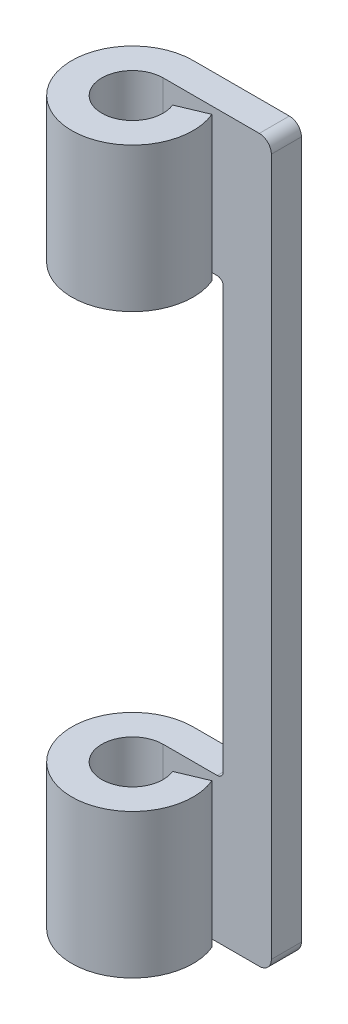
ISO-10303-21;
HEADER;
FILE_DESCRIPTION(('STEP AP214'),'2;1');
FILE_NAME('part.step','',(''),(''),'','','');
FILE_SCHEMA(('AUTOMOTIVE_DESIGN { 1 0 10303 214 1 1 1 1 }'));
ENDSEC;
DATA;
#1=APPLICATION_CONTEXT('core data for automotive mechanical design processes');
#2=APPLICATION_PROTOCOL_DEFINITION('international standard','automotive_design',2000,#1);
#3=PRODUCT_CONTEXT('',#1,'mechanical');
#4=PRODUCT('Part','Part','',(#3));
#5=PRODUCT_RELATED_PRODUCT_CATEGORY('part','',(#4));
#6=PRODUCT_DEFINITION_FORMATION('','',#4);
#7=PRODUCT_DEFINITION_CONTEXT('part definition',#1,'design');
#8=PRODUCT_DEFINITION('design','',#6,#7);
#9=PRODUCT_DEFINITION_SHAPE('','',#8);
#10=(LENGTH_UNIT() NAMED_UNIT(*) SI_UNIT(.MILLI.,.METRE.));
#11=(NAMED_UNIT(*) PLANE_ANGLE_UNIT() SI_UNIT($,.RADIAN.));
#12=(NAMED_UNIT(*) SI_UNIT($,.STERADIAN.) SOLID_ANGLE_UNIT());
#13=UNCERTAINTY_MEASURE_WITH_UNIT(LENGTH_MEASURE(1.E-05),#10,'distance_accuracy_value','');
#14=(GEOMETRIC_REPRESENTATION_CONTEXT(3) GLOBAL_UNCERTAINTY_ASSIGNED_CONTEXT((#13)) GLOBAL_UNIT_ASSIGNED_CONTEXT((#10,
#11,#12)) REPRESENTATION_CONTEXT('',''));
#15=CARTESIAN_POINT('',(0.,0.,0.));
#16=DIRECTION('',(0.,0.,1.));
#17=DIRECTION('',(1.,0.,0.));
#18=AXIS2_PLACEMENT_3D('',#15,#16,#17);
#19=CARTESIAN_POINT('',(4.658325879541,-30.,3.1));
#20=DIRECTION('',(-0.386138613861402,0.,-0.922440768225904));
#21=DIRECTION('',(-0.922440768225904,0.,0.386138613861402));
#22=AXIS2_PLACEMENT_3D('',#19,#20,#21);
#23=PLANE('',#22);
#24=DIRECTION('',(0.,1.,0.));
#25=VECTOR('',#24,1.);
#26=CARTESIAN_POINT('',(4.65832587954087,-30.,3.10000000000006));
#27=LINE('',#26,#25);
#28=CARTESIAN_POINT('',(4.65832587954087,18.,3.10000000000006));
#29=VERTEX_POINT('',#28);
#30=CARTESIAN_POINT('',(4.65832587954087,30.,3.10000000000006));
#31=VERTEX_POINT('',#30);
#32=EDGE_CURVE('E182',#29,#31,#27,.T.);
#33=ORIENTED_EDGE('',*,*,#32,.F.);
#34=DIRECTION('',(-0.92244076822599,0.,0.386138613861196));
#35=VECTOR('',#34,1.);
#36=CARTESIAN_POINT('',(4.658325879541,18.,3.1));
#37=LINE('',#36,#35);
#38=CARTESIAN_POINT('',(2.35222395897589,18.,4.06534653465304));
#39=VERTEX_POINT('',#38);
#40=EDGE_CURVE('E185',#29,#39,#37,.T.);
#41=ORIENTED_EDGE('',*,*,#40,.T.);
#42=DIRECTION('',(0.,1.,0.));
#43=VECTOR('',#42,1.);
#44=CARTESIAN_POINT('',(2.35222395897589,-30.,4.06534653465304));
#45=LINE('',#44,#43);
#46=CARTESIAN_POINT('',(2.35222395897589,30.,4.06534653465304));
#47=VERTEX_POINT('',#46);
#48=EDGE_CURVE('E145',#39,#47,#45,.T.);
#49=ORIENTED_EDGE('',*,*,#48,.T.);
#50=DIRECTION('',(-0.92244076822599,0.,0.386138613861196));
#51=VECTOR('',#50,1.);
#52=CARTESIAN_POINT('',(4.658325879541,30.,3.1));
#53=LINE('',#52,#51);
#54=EDGE_CURVE('E171',#31,#47,#53,.T.);
#55=ORIENTED_EDGE('',*,*,#54,.F.);
#56=EDGE_LOOP('',(#33,#41,#49,#55));
#57=FACE_BOUND('',#56,.T.);
#58=ADVANCED_FACE('F16',(#57),#23,.T.);
#59=CARTESIAN_POINT('',(0.,-30.,5.05));
#60=DIRECTION('',(0.,1.,0.));
#61=DIRECTION('',(0.,0.,1.));
#62=AXIS2_PLACEMENT_3D('',#59,#60,#61);
#63=CYLINDRICAL_SURFACE('',#62,2.55);
#64=CARTESIAN_POINT('',(0.,30.,5.05));
#65=DIRECTION('',(0.,1.,0.));
#66=DIRECTION('',(0.,0.,1.));
#67=AXIS2_PLACEMENT_3D('',#64,#65,#66);
#68=CIRCLE('',#67,2.55);
#69=CARTESIAN_POINT('',(0.,30.,2.5));
#70=VERTEX_POINT('',#69);
#71=EDGE_CURVE('E154',#47,#70,#68,.F.);
#72=ORIENTED_EDGE('',*,*,#71,.F.);
#73=ORIENTED_EDGE('',*,*,#48,.F.);
#74=CARTESIAN_POINT('',(0.,18.,5.05));
#75=DIRECTION('',(0.,1.,0.));
#76=DIRECTION('',(0.,0.,1.));
#77=AXIS2_PLACEMENT_3D('',#74,#75,#76);
#78=CIRCLE('',#77,2.55);
#79=CARTESIAN_POINT('',(0.,18.,2.5));
#80=VERTEX_POINT('',#79);
#81=EDGE_CURVE('E157',#39,#80,#78,.F.);
#82=ORIENTED_EDGE('',*,*,#81,.T.);
#83=DIRECTION('',(0.,1.,0.));
#84=VECTOR('',#83,1.);
#85=CARTESIAN_POINT('',(0.,-30.,2.5));
#86=LINE('',#85,#84);
#87=EDGE_CURVE('E150',#70,#80,#86,.F.);
#88=ORIENTED_EDGE('',*,*,#87,.F.);
#89=EDGE_LOOP('',(#72,#73,#82,#88));
#90=FACE_BOUND('',#89,.T.);
#91=ADVANCED_FACE('F152',(#90),#63,.F.);
#92=CARTESIAN_POINT('',(8.,29.,2.596018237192));
#93=DIRECTION('',(0.,0.,-1.));
#94=DIRECTION('',(-1.,0.,0.));
#95=AXIS2_PLACEMENT_3D('',#92,#93,#94);
#96=CYLINDRICAL_SURFACE('',#95,1.);
#97=CARTESIAN_POINT('',(8.,29.,2.5));
#98=DIRECTION('',(0.,0.,-1.));
#99=DIRECTION('',(-1.,0.,0.));
#100=AXIS2_PLACEMENT_3D('',#97,#98,#99);
#101=CIRCLE('',#100,1.);
#102=CARTESIAN_POINT('',(9.,29.,2.5));
#103=VERTEX_POINT('',#102);
#104=CARTESIAN_POINT('',(8.,30.,2.5));
#105=VERTEX_POINT('',#104);
#106=EDGE_CURVE('E161',#103,#105,#101,.F.);
#107=ORIENTED_EDGE('',*,*,#106,.F.);
#108=DIRECTION('',(0.,0.,-1.));
#109=VECTOR('',#108,1.);
#110=CARTESIAN_POINT('',(9.,29.,2.5));
#111=LINE('',#110,#109);
#112=CARTESIAN_POINT('',(9.,29.,0.));
#113=VERTEX_POINT('',#112);
#114=EDGE_CURVE('E232',#113,#103,#111,.F.);
#115=ORIENTED_EDGE('',*,*,#114,.F.);
#116=CARTESIAN_POINT('',(8.,29.,0.));
#117=DIRECTION('',(0.,0.,-1.));
#118=DIRECTION('',(-1.,0.,0.));
#119=AXIS2_PLACEMENT_3D('',#116,#117,#118);
#120=CIRCLE('',#119,1.);
#121=CARTESIAN_POINT('',(8.,30.,0.));
#122=VERTEX_POINT('',#121);
#123=EDGE_CURVE('E19',#113,#122,#120,.F.);
#124=ORIENTED_EDGE('',*,*,#123,.T.);
#125=DIRECTION('',(0.,0.,1.));
#126=VECTOR('',#125,1.);
#127=CARTESIAN_POINT('',(8.,30.,0.));
#128=LINE('',#127,#126);
#129=EDGE_CURVE('E168',#105,#122,#128,.F.);
#130=ORIENTED_EDGE('',*,*,#129,.F.);
#131=EDGE_LOOP('',(#107,#115,#124,#130));
#132=FACE_BOUND('',#131,.T.);
#133=ADVANCED_FACE('F259',(#132),#96,.T.);
#134=CARTESIAN_POINT('',(8.,-29.,-0.09771170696));
#135=DIRECTION('',(0.,0.,1.));
#136=DIRECTION('',(1.,0.,0.));
#137=AXIS2_PLACEMENT_3D('',#134,#135,#136);
#138=CYLINDRICAL_SURFACE('',#137,1.);
#139=CARTESIAN_POINT('',(8.,-29.,0.));
#140=DIRECTION('',(0.,0.,1.));
#141=DIRECTION('',(1.,0.,0.));
#142=AXIS2_PLACEMENT_3D('',#139,#140,#141);
#143=CIRCLE('',#142,1.);
#144=CARTESIAN_POINT('',(8.,-30.,0.));
#145=VERTEX_POINT('',#144);
#146=CARTESIAN_POINT('',(9.,-29.,0.));
#147=VERTEX_POINT('',#146);
#148=EDGE_CURVE('E196',#145,#147,#143,.T.);
#149=ORIENTED_EDGE('',*,*,#148,.T.);
#150=DIRECTION('',(0.,0.,-1.));
#151=VECTOR('',#150,1.);
#152=CARTESIAN_POINT('',(9.,-29.,2.5));
#153=LINE('',#152,#151);
#154=CARTESIAN_POINT('',(9.,-29.,2.5));
#155=VERTEX_POINT('',#154);
#156=EDGE_CURVE('E235',#155,#147,#153,.T.);
#157=ORIENTED_EDGE('',*,*,#156,.F.);
#158=CARTESIAN_POINT('',(8.,-29.,2.5));
#159=DIRECTION('',(0.,0.,1.));
#160=DIRECTION('',(1.,0.,0.));
#161=AXIS2_PLACEMENT_3D('',#158,#159,#160);
#162=CIRCLE('',#161,1.);
#163=CARTESIAN_POINT('',(8.,-30.,2.5));
#164=VERTEX_POINT('',#163);
#165=EDGE_CURVE('E192',#164,#155,#162,.T.);
#166=ORIENTED_EDGE('',*,*,#165,.F.);
#167=DIRECTION('',(0.,0.,1.));
#168=VECTOR('',#167,1.);
#169=CARTESIAN_POINT('',(8.,-30.,0.));
#170=LINE('',#169,#168);
#171=EDGE_CURVE('E230',#164,#145,#170,.F.);
#172=ORIENTED_EDGE('',*,*,#171,.T.);
#173=EDGE_LOOP('',(#149,#157,#166,#172));
#174=FACE_BOUND('',#173,.T.);
#175=ADVANCED_FACE('F256',(#174),#138,.T.);
#176=CARTESIAN_POINT('',(4.658325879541,-30.,3.1));
#177=DIRECTION('',(-0.386138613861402,0.,-0.922440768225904));
#178=DIRECTION('',(-0.922440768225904,0.,0.386138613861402));
#179=AXIS2_PLACEMENT_3D('',#176,#177,#178);
#180=PLANE('',#179);
#181=DIRECTION('',(0.,1.,0.));
#182=VECTOR('',#181,1.);
#183=CARTESIAN_POINT('',(2.35222395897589,-30.,4.06534653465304));
#184=LINE('',#183,#182);
#185=CARTESIAN_POINT('',(2.35222395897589,-30.,4.06534653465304));
#186=VERTEX_POINT('',#185);
#187=CARTESIAN_POINT('',(2.35222395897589,-18.,4.06534653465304));
#188=VERTEX_POINT('',#187);
#189=EDGE_CURVE('E195',#186,#188,#184,.T.);
#190=ORIENTED_EDGE('',*,*,#189,.T.);
#191=DIRECTION('',(-0.92244076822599,0.,0.386138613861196));
#192=VECTOR('',#191,1.);
#193=CARTESIAN_POINT('',(4.658325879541,-18.,3.1));
#194=LINE('',#193,#192);
#195=CARTESIAN_POINT('',(4.65832587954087,-18.,3.10000000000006));
#196=VERTEX_POINT('',#195);
#197=EDGE_CURVE('E210',#196,#188,#194,.T.);
#198=ORIENTED_EDGE('',*,*,#197,.F.);
#199=DIRECTION('',(0.,1.,0.));
#200=VECTOR('',#199,1.);
#201=CARTESIAN_POINT('',(4.65832587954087,-30.,3.10000000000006));
#202=LINE('',#201,#200);
#203=CARTESIAN_POINT('',(4.65832587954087,-30.,3.10000000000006));
#204=VERTEX_POINT('',#203);
#205=EDGE_CURVE('E213',#204,#196,#202,.T.);
#206=ORIENTED_EDGE('',*,*,#205,.F.);
#207=DIRECTION('',(-0.92244076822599,0.,0.386138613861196));
#208=VECTOR('',#207,1.);
#209=CARTESIAN_POINT('',(4.658325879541,-30.,3.1));
#210=LINE('',#209,#208);
#211=EDGE_CURVE('E224',#204,#186,#210,.T.);
#212=ORIENTED_EDGE('',*,*,#211,.T.);
#213=EDGE_LOOP('',(#190,#198,#206,#212));
#214=FACE_BOUND('',#213,.T.);
#215=ADVANCED_FACE('F258',(#214),#180,.T.);
#216=CARTESIAN_POINT('',(0.,-30.,5.05));
#217=DIRECTION('',(0.,1.,0.));
#218=DIRECTION('',(0.,0.,1.));
#219=AXIS2_PLACEMENT_3D('',#216,#217,#218);
#220=CYLINDRICAL_SURFACE('',#219,2.55);
#221=CARTESIAN_POINT('',(0.,-30.,5.05));
#222=DIRECTION('',(0.,1.,0.));
#223=DIRECTION('',(0.,0.,1.));
#224=AXIS2_PLACEMENT_3D('',#221,#222,#223);
#225=CIRCLE('',#224,2.55);
#226=CARTESIAN_POINT('',(0.,-30.,2.5));
#227=VERTEX_POINT('',#226);
#228=EDGE_CURVE('E176',#186,#227,#225,.F.);
#229=ORIENTED_EDGE('',*,*,#228,.T.);
#230=DIRECTION('',(0.,1.,0.));
#231=VECTOR('',#230,1.);
#232=CARTESIAN_POINT('',(0.,-30.,2.5));
#233=LINE('',#232,#231);
#234=CARTESIAN_POINT('',(0.,-18.,2.5));
#235=VERTEX_POINT('',#234);
#236=EDGE_CURVE('E124',#235,#227,#233,.F.);
#237=ORIENTED_EDGE('',*,*,#236,.F.);
#238=CARTESIAN_POINT('',(0.,-18.,5.05));
#239=DIRECTION('',(0.,1.,0.));
#240=DIRECTION('',(0.,0.,1.));
#241=AXIS2_PLACEMENT_3D('',#238,#239,#240);
#242=CIRCLE('',#241,2.55);
#243=EDGE_CURVE('E206',#188,#235,#242,.F.);
#244=ORIENTED_EDGE('',*,*,#243,.F.);
#245=ORIENTED_EDGE('',*,*,#189,.F.);
#246=EDGE_LOOP('',(#229,#237,#244,#245));
#247=FACE_BOUND('',#246,.T.);
#248=ADVANCED_FACE('F266',(#247),#220,.F.);
#249=CARTESIAN_POINT('',(4.5,17.5,2.596018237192));
#250=DIRECTION('',(0.,0.,-1.));
#251=DIRECTION('',(-1.,0.,0.));
#252=AXIS2_PLACEMENT_3D('',#249,#250,#251);
#253=CYLINDRICAL_SURFACE('',#252,0.5);
#254=DIRECTION('',(0.,0.,-1.));
#255=VECTOR('',#254,1.);
#256=CARTESIAN_POINT('',(5.,17.5,2.5));
#257=LINE('',#256,#255);
#258=CARTESIAN_POINT('',(5.,17.5,0.));
#259=VERTEX_POINT('',#258);
#260=CARTESIAN_POINT('',(5.,17.5,2.5));
#261=VERTEX_POINT('',#260);
#262=EDGE_CURVE('E251',#259,#261,#257,.F.);
#263=ORIENTED_EDGE('',*,*,#262,.T.);
#264=CARTESIAN_POINT('',(4.5,17.5,2.5));
#265=DIRECTION('',(0.,0.,-1.));
#266=DIRECTION('',(-1.,0.,0.));
#267=AXIS2_PLACEMENT_3D('',#264,#265,#266);
#268=CIRCLE('',#267,0.5);
#269=CARTESIAN_POINT('',(4.5,18.,2.5));
#270=VERTEX_POINT('',#269);
#271=EDGE_CURVE('E160',#270,#261,#268,.T.);
#272=ORIENTED_EDGE('',*,*,#271,.F.);
#273=DIRECTION('',(0.,0.,1.));
#274=VECTOR('',#273,1.);
#275=CARTESIAN_POINT('',(4.5,18.,0.));
#276=LINE('',#275,#274);
#277=CARTESIAN_POINT('',(4.5,18.,0.));
#278=VERTEX_POINT('',#277);
#279=EDGE_CURVE('E187',#270,#278,#276,.F.);
#280=ORIENTED_EDGE('',*,*,#279,.T.);
#281=CARTESIAN_POINT('',(4.5,17.5,0.));
#282=DIRECTION('',(0.,0.,-1.));
#283=DIRECTION('',(-1.,0.,0.));
#284=AXIS2_PLACEMENT_3D('',#281,#282,#283);
#285=CIRCLE('',#284,0.5);
#286=EDGE_CURVE('E194',#259,#278,#285,.F.);
#287=ORIENTED_EDGE('',*,*,#286,.F.);
#288=EDGE_LOOP('',(#263,#272,#280,#287));
#289=FACE_BOUND('',#288,.T.);
#290=ADVANCED_FACE('F308',(#289),#253,.F.);
#291=CARTESIAN_POINT('',(0.,-30.,2.5));
#292=DIRECTION('',(0.,0.,1.));
#293=DIRECTION('',(1.,0.,0.));
#294=AXIS2_PLACEMENT_3D('',#291,#292,#293);
#295=PLANE('',#294);
#296=CARTESIAN_POINT('',(4.5,-17.5,2.5));
#297=DIRECTION('',(0.,0.,1.));
#298=DIRECTION('',(1.,0.,0.));
#299=AXIS2_PLACEMENT_3D('',#296,#297,#298);
#300=CIRCLE('',#299,0.5);
#301=CARTESIAN_POINT('',(5.,-17.5,2.5));
#302=VERTEX_POINT('',#301);
#303=CARTESIAN_POINT('',(4.5,-18.,2.5));
#304=VERTEX_POINT('',#303);
#305=EDGE_CURVE('E115',#302,#304,#300,.F.);
#306=ORIENTED_EDGE('',*,*,#305,.T.);
#307=DIRECTION('',(1.,0.,0.));
#308=VECTOR('',#307,1.);
#309=CARTESIAN_POINT('',(0.,-18.,2.5));
#310=LINE('',#309,#308);
#311=EDGE_CURVE('E209',#235,#304,#310,.T.);
#312=ORIENTED_EDGE('',*,*,#311,.F.);
#313=ORIENTED_EDGE('',*,*,#236,.T.);
#314=DIRECTION('',(1.,0.,0.));
#315=VECTOR('',#314,1.);
#316=CARTESIAN_POINT('',(0.,-30.,2.5));
#317=LINE('',#316,#315);
#318=EDGE_CURVE('E216',#227,#164,#317,.T.);
#319=ORIENTED_EDGE('',*,*,#318,.T.);
#320=ORIENTED_EDGE('',*,*,#165,.T.);
#321=DIRECTION('',(0.,1.,0.));
#322=VECTOR('',#321,1.);
#323=CARTESIAN_POINT('',(9.,-30.,2.5));
#324=LINE('',#323,#322);
#325=EDGE_CURVE('E236',#103,#155,#324,.F.);
#326=ORIENTED_EDGE('',*,*,#325,.F.);
#327=ORIENTED_EDGE('',*,*,#106,.T.);
#328=DIRECTION('',(1.,0.,0.));
#329=VECTOR('',#328,1.);
#330=CARTESIAN_POINT('',(0.,30.,2.5));
#331=LINE('',#330,#329);
#332=EDGE_CURVE('E164',#70,#105,#331,.T.);
#333=ORIENTED_EDGE('',*,*,#332,.F.);
#334=ORIENTED_EDGE('',*,*,#87,.T.);
#335=DIRECTION('',(1.,0.,0.));
#336=VECTOR('',#335,1.);
#337=CARTESIAN_POINT('',(0.,18.,2.5));
#338=LINE('',#337,#336);
#339=EDGE_CURVE('E184',#80,#270,#338,.T.);
#340=ORIENTED_EDGE('',*,*,#339,.T.);
#341=ORIENTED_EDGE('',*,*,#271,.T.);
#342=DIRECTION('',(0.,1.,0.));
#343=VECTOR('',#342,1.);
#344=CARTESIAN_POINT('',(5.,18.,2.5));
#345=LINE('',#344,#343);
#346=EDGE_CURVE('E248',#261,#302,#345,.F.);
#347=ORIENTED_EDGE('',*,*,#346,.T.);
#348=EDGE_LOOP('',(#306,#312,#313,#319,#320,#326,#327,#333,#334,#340,#341,#347));
#349=FACE_BOUND('',#348,.T.);
#350=ADVANCED_FACE('F165',(#349),#295,.T.);
#351=CARTESIAN_POINT('',(4.5,-17.5,-0.09232407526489));
#352=DIRECTION('',(0.,0.,1.));
#353=DIRECTION('',(1.,0.,0.));
#354=AXIS2_PLACEMENT_3D('',#351,#352,#353);
#355=CYLINDRICAL_SURFACE('',#354,0.5);
#356=DIRECTION('',(0.,0.,-1.));
#357=VECTOR('',#356,1.);
#358=CARTESIAN_POINT('',(5.,-17.5,2.5));
#359=LINE('',#358,#357);
#360=CARTESIAN_POINT('',(5.,-17.5,0.));
#361=VERTEX_POINT('',#360);
#362=EDGE_CURVE('E250',#302,#361,#359,.T.);
#363=ORIENTED_EDGE('',*,*,#362,.T.);
#364=CARTESIAN_POINT('',(4.5,-17.5,0.));
#365=DIRECTION('',(0.,0.,1.));
#366=DIRECTION('',(1.,0.,0.));
#367=AXIS2_PLACEMENT_3D('',#364,#365,#366);
#368=CIRCLE('',#367,0.5);
#369=CARTESIAN_POINT('',(4.5,-18.,0.));
#370=VERTEX_POINT('',#369);
#371=EDGE_CURVE('E33',#370,#361,#368,.T.);
#372=ORIENTED_EDGE('',*,*,#371,.F.);
#373=DIRECTION('',(0.,0.,1.));
#374=VECTOR('',#373,1.);
#375=CARTESIAN_POINT('',(4.5,-18.,0.));
#376=LINE('',#375,#374);
#377=EDGE_CURVE('E227',#304,#370,#376,.F.);
#378=ORIENTED_EDGE('',*,*,#377,.F.);
#379=ORIENTED_EDGE('',*,*,#305,.F.);
#380=EDGE_LOOP('',(#363,#372,#378,#379));
#381=FACE_BOUND('',#380,.T.);
#382=ADVANCED_FACE('F301',(#381),#355,.F.);
#383=CARTESIAN_POINT('',(0.,18.,0.));
#384=DIRECTION('',(0.,1.,0.));
#385=DIRECTION('',(0.,0.,1.));
#386=AXIS2_PLACEMENT_3D('',#383,#384,#385);
#387=PLANE('',#386);
#388=ORIENTED_EDGE('',*,*,#81,.F.);
#389=ORIENTED_EDGE('',*,*,#40,.F.);
#390=CARTESIAN_POINT('',(0.,18.,5.05));
#391=DIRECTION('',(0.,1.,0.));
#392=DIRECTION('',(0.,0.,1.));
#393=AXIS2_PLACEMENT_3D('',#390,#391,#392);
#394=CIRCLE('',#393,5.05);
#395=CARTESIAN_POINT('',(0.,18.,0.));
#396=VERTEX_POINT('',#395);
#397=EDGE_CURVE('E179',#396,#29,#394,.T.);
#398=ORIENTED_EDGE('',*,*,#397,.F.);
#399=DIRECTION('',(-1.,0.,0.));
#400=VECTOR('',#399,1.);
#401=CARTESIAN_POINT('',(9.,18.,0.));
#402=LINE('',#401,#400);
#403=EDGE_CURVE('E242',#278,#396,#402,.T.);
#404=ORIENTED_EDGE('',*,*,#403,.F.);
#405=ORIENTED_EDGE('',*,*,#279,.F.);
#406=ORIENTED_EDGE('',*,*,#339,.F.);
#407=EDGE_LOOP('',(#388,#389,#398,#404,#405,#406));
#408=FACE_BOUND('',#407,.T.);
#409=ADVANCED_FACE('F298',(#408),#387,.F.);
#410=CARTESIAN_POINT('',(0.,-30.,5.05));
#411=DIRECTION('',(0.,1.,0.));
#412=DIRECTION('',(0.,0.,1.));
#413=AXIS2_PLACEMENT_3D('',#410,#411,#412);
#414=CYLINDRICAL_SURFACE('',#413,5.05);
#415=DIRECTION('',(0.,1.,0.));
#416=VECTOR('',#415,1.);
#417=CARTESIAN_POINT('',(0.,-30.,0.));
#418=LINE('',#417,#416);
#419=CARTESIAN_POINT('',(0.,30.,0.));
#420=VERTEX_POINT('',#419);
#421=EDGE_CURVE('E238',#396,#420,#418,.T.);
#422=ORIENTED_EDGE('',*,*,#421,.F.);
#423=ORIENTED_EDGE('',*,*,#397,.T.);
#424=ORIENTED_EDGE('',*,*,#32,.T.);
#425=CARTESIAN_POINT('',(0.,30.,5.05));
#426=DIRECTION('',(0.,1.,0.));
#427=DIRECTION('',(0.,0.,1.));
#428=AXIS2_PLACEMENT_3D('',#425,#426,#427);
#429=CIRCLE('',#428,5.05);
#430=EDGE_CURVE('E91',#420,#31,#429,.T.);
#431=ORIENTED_EDGE('',*,*,#430,.F.);
#432=EDGE_LOOP('',(#422,#423,#424,#431));
#433=FACE_BOUND('',#432,.T.);
#434=ADVANCED_FACE('F295',(#433),#414,.T.);
#435=CARTESIAN_POINT('',(0.,30.,0.));
#436=DIRECTION('',(0.,1.,0.));
#437=DIRECTION('',(0.,0.,1.));
#438=AXIS2_PLACEMENT_3D('',#435,#436,#437);
#439=PLANE('',#438);
#440=ORIENTED_EDGE('',*,*,#332,.T.);
#441=ORIENTED_EDGE('',*,*,#129,.T.);
#442=DIRECTION('',(-1.,0.,0.));
#443=VECTOR('',#442,1.);
#444=CARTESIAN_POINT('',(9.,30.,0.));
#445=LINE('',#444,#443);
#446=EDGE_CURVE('E241',#420,#122,#445,.F.);
#447=ORIENTED_EDGE('',*,*,#446,.F.);
#448=ORIENTED_EDGE('',*,*,#430,.T.);
#449=ORIENTED_EDGE('',*,*,#54,.T.);
#450=ORIENTED_EDGE('',*,*,#71,.T.);
#451=EDGE_LOOP('',(#440,#441,#447,#448,#449,#450));
#452=FACE_BOUND('',#451,.T.);
#453=ADVANCED_FACE('F170',(#452),#439,.T.);
#454=CARTESIAN_POINT('',(9.,-30.,2.5));
#455=DIRECTION('',(1.,0.,0.));
#456=DIRECTION('',(0.,0.,-1.));
#457=AXIS2_PLACEMENT_3D('',#454,#455,#456);
#458=PLANE('',#457);
#459=DIRECTION('',(0.,1.,0.));
#460=VECTOR('',#459,1.);
#461=CARTESIAN_POINT('',(9.,-30.,0.));
#462=LINE('',#461,#460);
#463=EDGE_CURVE('E323',#113,#147,#462,.F.);
#464=ORIENTED_EDGE('',*,*,#463,.F.);
#465=ORIENTED_EDGE('',*,*,#114,.T.);
#466=ORIENTED_EDGE('',*,*,#325,.T.);
#467=ORIENTED_EDGE('',*,*,#156,.T.);
#468=EDGE_LOOP('',(#464,#465,#466,#467));
#469=FACE_BOUND('',#468,.T.);
#470=ADVANCED_FACE('F255',(#469),#458,.T.);
#471=CARTESIAN_POINT('',(0.,-30.,0.));
#472=DIRECTION('',(0.,1.,0.));
#473=DIRECTION('',(0.,0.,1.));
#474=AXIS2_PLACEMENT_3D('',#471,#472,#473);
#475=PLANE('',#474);
#476=ORIENTED_EDGE('',*,*,#228,.F.);
#477=ORIENTED_EDGE('',*,*,#211,.F.);
#478=CARTESIAN_POINT('',(0.,-30.,5.05));
#479=DIRECTION('',(0.,1.,0.));
#480=DIRECTION('',(0.,0.,1.));
#481=AXIS2_PLACEMENT_3D('',#478,#479,#480);
#482=CIRCLE('',#481,5.05);
#483=CARTESIAN_POINT('',(0.,-30.,0.));
#484=VERTEX_POINT('',#483);
#485=EDGE_CURVE('E214',#484,#204,#482,.T.);
#486=ORIENTED_EDGE('',*,*,#485,.F.);
#487=DIRECTION('',(-1.,0.,0.));
#488=VECTOR('',#487,1.);
#489=CARTESIAN_POINT('',(9.,-30.,0.));
#490=LINE('',#489,#488);
#491=EDGE_CURVE('E320',#145,#484,#490,.T.);
#492=ORIENTED_EDGE('',*,*,#491,.F.);
#493=ORIENTED_EDGE('',*,*,#171,.F.);
#494=ORIENTED_EDGE('',*,*,#318,.F.);
#495=EDGE_LOOP('',(#476,#477,#486,#492,#493,#494));
#496=FACE_BOUND('',#495,.T.);
#497=ADVANCED_FACE('F287',(#496),#475,.F.);
#498=CARTESIAN_POINT('',(0.,-30.,5.05));
#499=DIRECTION('',(0.,1.,0.));
#500=DIRECTION('',(0.,0.,1.));
#501=AXIS2_PLACEMENT_3D('',#498,#499,#500);
#502=CYLINDRICAL_SURFACE('',#501,5.05);
#503=ORIENTED_EDGE('',*,*,#205,.T.);
#504=CARTESIAN_POINT('',(0.,-18.,5.05));
#505=DIRECTION('',(0.,1.,0.));
#506=DIRECTION('',(0.,0.,1.));
#507=AXIS2_PLACEMENT_3D('',#504,#505,#506);
#508=CIRCLE('',#507,5.05);
#509=CARTESIAN_POINT('',(0.,-18.,0.));
#510=VERTEX_POINT('',#509);
#511=EDGE_CURVE('E211',#510,#196,#508,.T.);
#512=ORIENTED_EDGE('',*,*,#511,.F.);
#513=DIRECTION('',(0.,1.,0.));
#514=VECTOR('',#513,1.);
#515=CARTESIAN_POINT('',(0.,-30.,0.));
#516=LINE('',#515,#514);
#517=EDGE_CURVE('E322',#484,#510,#516,.T.);
#518=ORIENTED_EDGE('',*,*,#517,.F.);
#519=ORIENTED_EDGE('',*,*,#485,.T.);
#520=EDGE_LOOP('',(#503,#512,#518,#519));
#521=FACE_BOUND('',#520,.T.);
#522=ADVANCED_FACE('F283',(#521),#502,.T.);
#523=CARTESIAN_POINT('',(0.,-18.,0.));
#524=DIRECTION('',(0.,1.,0.));
#525=DIRECTION('',(0.,0.,1.));
#526=AXIS2_PLACEMENT_3D('',#523,#524,#525);
#527=PLANE('',#526);
#528=ORIENTED_EDGE('',*,*,#311,.T.);
#529=ORIENTED_EDGE('',*,*,#377,.T.);
#530=DIRECTION('',(-1.,0.,0.));
#531=VECTOR('',#530,1.);
#532=CARTESIAN_POINT('',(9.,-18.,0.));
#533=LINE('',#532,#531);
#534=EDGE_CURVE('E25',#510,#370,#533,.F.);
#535=ORIENTED_EDGE('',*,*,#534,.F.);
#536=ORIENTED_EDGE('',*,*,#511,.T.);
#537=ORIENTED_EDGE('',*,*,#197,.T.);
#538=ORIENTED_EDGE('',*,*,#243,.T.);
#539=EDGE_LOOP('',(#528,#529,#535,#536,#537,#538));
#540=FACE_BOUND('',#539,.T.);
#541=ADVANCED_FACE('F277',(#540),#527,.T.);
#542=CARTESIAN_POINT('',(5.,18.,2.5));
#543=DIRECTION('',(1.,0.,0.));
#544=DIRECTION('',(0.,0.,-1.));
#545=AXIS2_PLACEMENT_3D('',#542,#543,#544);
#546=PLANE('',#545);
#547=ORIENTED_EDGE('',*,*,#362,.F.);
#548=ORIENTED_EDGE('',*,*,#346,.F.);
#549=ORIENTED_EDGE('',*,*,#262,.F.);
#550=DIRECTION('',(0.,1.,0.));
#551=VECTOR('',#550,1.);
#552=CARTESIAN_POINT('',(5.,-30.,0.));
#553=LINE('',#552,#551);
#554=EDGE_CURVE('E11',#361,#259,#553,.T.);
#555=ORIENTED_EDGE('',*,*,#554,.F.);
#556=EDGE_LOOP('',(#547,#548,#549,#555));
#557=FACE_BOUND('',#556,.T.);
#558=ADVANCED_FACE('F272',(#557),#546,.F.);
#559=CARTESIAN_POINT('',(9.,-30.,0.));
#560=DIRECTION('',(0.,0.,-1.));
#561=DIRECTION('',(-1.,0.,0.));
#562=AXIS2_PLACEMENT_3D('',#559,#560,#561);
#563=PLANE('',#562);
#564=ORIENTED_EDGE('',*,*,#371,.T.);
#565=ORIENTED_EDGE('',*,*,#554,.T.);
#566=ORIENTED_EDGE('',*,*,#286,.T.);
#567=ORIENTED_EDGE('',*,*,#403,.T.);
#568=ORIENTED_EDGE('',*,*,#421,.T.);
#569=ORIENTED_EDGE('',*,*,#446,.T.);
#570=ORIENTED_EDGE('',*,*,#123,.F.);
#571=ORIENTED_EDGE('',*,*,#463,.T.);
#572=ORIENTED_EDGE('',*,*,#148,.F.);
#573=ORIENTED_EDGE('',*,*,#491,.T.);
#574=ORIENTED_EDGE('',*,*,#517,.T.);
#575=ORIENTED_EDGE('',*,*,#534,.T.);
#576=EDGE_LOOP('',(#564,#565,#566,#567,#568,#569,#570,#571,#572,#573,#574,#575));
#577=FACE_BOUND('',#576,.T.);
#578=ADVANCED_FACE('F270',(#577),#563,.T.);
#579=CLOSED_SHELL('',(#58,#91,#133,#175,#215,#248,#290,#350,#382,#409,#434,#453,#470,#497,#522,
#541,#558,#578));
#580=MANIFOLD_SOLID_BREP('B1',#579);
#581=ADVANCED_BREP_SHAPE_REPRESENTATION('',(#18,#580),#14);
#582=SHAPE_DEFINITION_REPRESENTATION(#9,#581);
ENDSEC;
END-ISO-10303-21;
